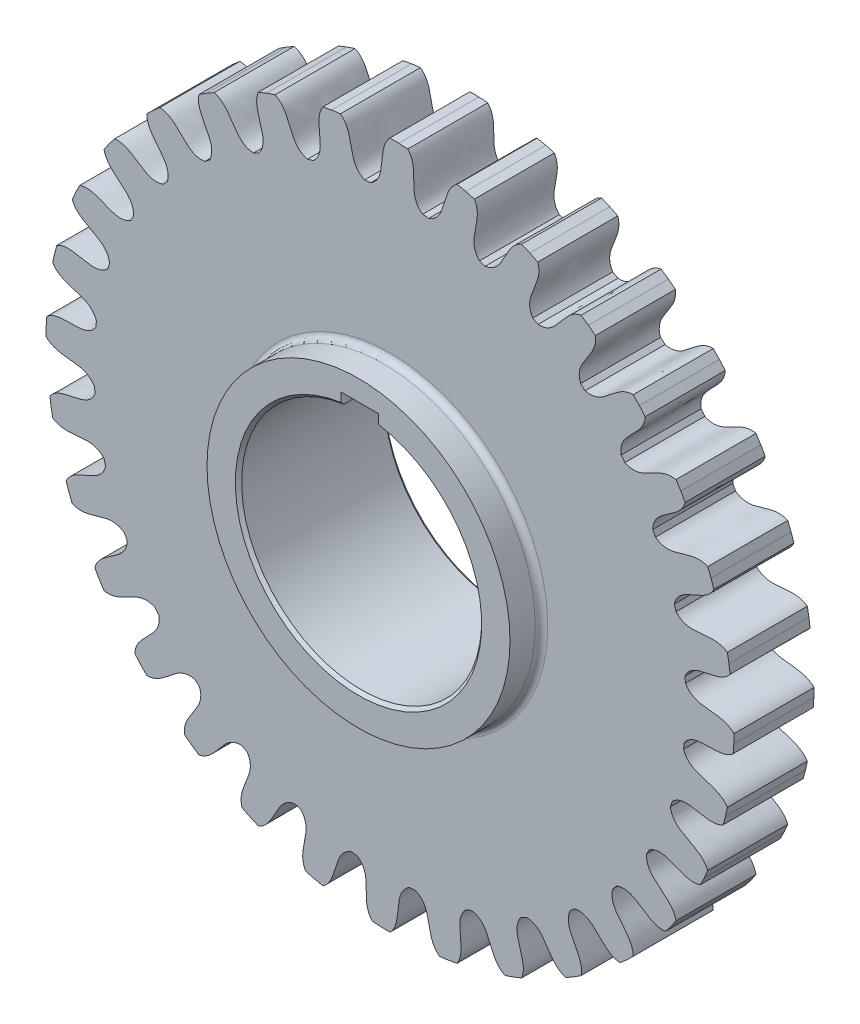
from build123d import *

# Parameters (mm, degrees)
AUFSATZ_LINEAR_AUSTRAGEN1_DEPTH = 13.081
SKIZZE2_R                       = 24.7715
AUFSATZ_LINEAR_AUSTRAGEN2_DEPTH = 5.15
AUFSATZ_LINEAR_START            = 6.18
SKIZZE3_R                       = 24.7715
AUFSATZ_LINEAR_AUSTRAGEN3_DEPTH = 6.18
SCHNITT_LINEAR_AUSTRAGEN1_DEPTH = 84.194484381
SKIZZE5_W                       = 19.6215
SKIZZE5_H                       = 24.411
FASE1_SIZE                      = 0.515
ZAHNRAD_R                       = 1.03


with BuildPart() as part:
    # Skizze1 → Aufsatz-Linear austragen1 (new body)
    with BuildSketch(Plane.XY.offset(13.081)):
        with BuildLine():
            Line((22.855064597, 51.384420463), (21.521350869, 51.957137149))
            add(Edge.make_bspline(
                [(15.55468588, 45.842991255), (18.896430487, 46.321686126), (18.613373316, 50.778897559), (21.521350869, 51.957137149)],
                knots=[0, 0, 0, 0, 1, 1, 1, 1], degree=3))
            ThreePointArc((15.55468588, 45.842991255), (15.090249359, 45.997961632), (14.624269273, 46.148226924))
            add(Edge.make_bspline(
                [(13.791563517, 54.473680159), (15.409186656, 51.825446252), (12.308759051, 48.516392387), (14.624269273, 46.148226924)],
                knots=[0, 0, 0, 0, 1, 1, 1, 1], degree=3))
            Line((13.791563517, 54.473680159), (12.391307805, 54.855885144))
            Line((12.391307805, 54.855885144), (10.97148953, 55.157402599))
            add(Edge.make_bspline(
                [(6.312283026, 47.996699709), (9.496428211, 49.118138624), (8.349251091, 53.434484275), (10.97148953, 55.157402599)],
                knots=[0, 0, 0, 0, 1, 1, 1, 1], degree=3))
            ThreePointArc((6.312283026, 47.996699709), (5.826537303, 48.058085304), (5.340195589, 48.114555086))
            add(Edge.make_bspline(
                [(2.899274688, 56.117584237), (5.002460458, 53.835818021), (2.607171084, 49.985483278), (5.340195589, 48.114555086)],
                knots=[0, 0, 0, 0, 1, 1, 1, 1], degree=3))
            Line((2.899274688, 56.117584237), (1.451360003, 56.219268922))
            Line((1.451360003, 56.219268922), (0, 56.238))
            add(Edge.make_bspline(
                [(-3.172697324, 48.305921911), (-0.268516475, 50.027008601), (-2.235728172, 54.036613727), (0, 56.238)],
                knots=[0, 0, 0, 0, 1, 1, 1, 1], degree=3))
            ThreePointArc((-3.172697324, 48.305921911), (-3.661085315, 48.271363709), (-4.149098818, 48.231867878))
            add(Edge.make_bspline(
                [(-8.104431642, 55.604921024), (-5.596507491, 53.777309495), (-7.194609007, 49.533660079), (-4.149098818, 48.231867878)],
                knots=[0, 0, 0, 0, 1, 1, 1, 1], degree=3))
            Line((-8.104431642, 55.604921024), (-9.54436275, 55.422177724))
            Line((-9.54436275, 55.422177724), (-10.97148953, 55.157402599))
            add(Edge.make_bspline(
                [(-12.535752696, 46.758774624), (-10.023142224, 49.013368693), (-12.734789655, 52.562146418), (-10.97148953, 55.157402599)],
                knots=[0, 0, 0, 0, 1, 1, 1, 1], degree=3))
            ThreePointArc((-12.535752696, 46.758774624), (-13.008014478, 46.629600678), (-13.478945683, 46.495657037))
            add(Edge.make_bspline(
                [(-18.796689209, 52.955391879), (-15.980404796, 51.652169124), (-16.719904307, 47.178286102), (-13.478945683, 46.495657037)],
                knots=[0, 0, 0, 0, 1, 1, 1, 1], degree=3))
            Line((-18.796689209, 52.955391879), (-20.173300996, 52.495243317))
            Line((-20.173300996, 52.495243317), (-21.521350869, 51.957137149))
            add(Edge.make_bspline(
                [(-21.417066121, 43.414713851), (-19.392584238, 46.116172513), (-22.744460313, 49.067745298), (-21.521350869, 51.957137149)],
                knots=[0, 0, 0, 0, 1, 1, 1, 1], degree=3))
            ThreePointArc((-21.417066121, 43.414713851), (-21.855052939, 43.195888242), (-22.290804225, 42.972644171))
            add(Edge.make_bspline(
                [(-28.766600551, 48.270816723), (-25.750184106, 47.54206486), (-25.602663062, 43.009877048), (-22.290804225, 42.972644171)],
                knots=[0, 0, 0, 0, 1, 1, 1, 1], degree=3))
            Line((-28.766600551, 48.270816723), (-30.026990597, 47.550946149))
            Line((-30.026990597, 47.550946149), (-31.244158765, 46.760188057))
            add(Edge.make_bspline(
                [(-29.475333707, 38.402249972), (-28.016780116, 41.446757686), (-31.880074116, 43.687698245), (-31.244158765, 46.760188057)],
                knots=[0, 0, 0, 0, 1, 1, 1, 1], degree=3))
            ThreePointArc((-29.475333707, 38.402249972), (-29.862213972, 38.102182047), (-30.246039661, 37.798216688))
            add(Edge.make_bspline(
                [(-37.631027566, 41.73122115), (-34.530398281, 41.604945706), (-33.501525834, 37.18862254), (-30.246039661, 37.798216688)],
                knots=[0, 0, 0, 0, 1, 1, 1, 1], degree=3))
            Line((-37.631027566, 41.73122115), (-38.726759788, 40.779292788))
            Line((-38.726759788, 40.779292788), (-39.76627116, 39.76627116))
            add(Edge.make_bspline(
                [(-36.400880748, 31.914009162), (-35.564306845, 35.184567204), (-39.79055455, 36.628757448), (-39.76627116, 39.76627116)],
                knots=[0, 0, 0, 0, 1, 1, 1, 1], degree=3))
            ThreePointArc((-36.400880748, 31.914009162), (-36.721786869, 31.544230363), (-37.038936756, 31.171224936))
            add(Edge.make_bspline(
                [(-45.049315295, 33.587918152), (-41.983628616, 34.06897182), (-40.112943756, 29.938230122), (-37.038936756, 31.171224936)],
                knots=[0, 0, 0, 0, 1, 1, 1, 1], degree=3))
            Line((-45.049315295, 33.587918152), (-45.93828132, 32.440514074))
            Line((-45.93828132, 32.440514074), (-46.760188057, 31.244158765))
            add(Edge.make_bspline(
                [(-41.927562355, 24.199330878), (-41.745117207, 27.570253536), (-46.171906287, 28.162194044), (-46.760188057, 31.244158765)],
                knots=[0, 0, 0, 0, 1, 1, 1, 1], degree=3))
            ThreePointArc((-41.927562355, 24.199330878), (-42.17016209, 23.774051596), (-42.408448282, 23.346340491))
            add(Edge.make_bspline(
                [(-50.736383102, 24.153850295), (-47.823451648, 25.223746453), (-45.182843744, 21.537328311), (-42.408448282, 23.346340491)],
                knots=[0, 0, 0, 0, 1, 1, 1, 1], degree=3))
            Line((-50.736383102, 24.153850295), (-51.384420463, 22.855064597))
            Line((-51.384420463, 22.855064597), (-51.957137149, 21.521350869))
            add(Edge.make_bspline(
                [(-45.842991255, 15.55468588), (-46.321686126, 18.896430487), (-50.778897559, 18.613373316), (-51.957137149, 21.521350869)],
                knots=[0, 0, 0, 0, 1, 1, 1, 1], degree=3))
            ThreePointArc((-45.842991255, 15.55468588), (-45.997961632, 15.090249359), (-46.148226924, 14.624269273))
            add(Edge.make_bspline(
                [(-54.473680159, 13.791563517), (-51.825446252, 15.409186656), (-48.516392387, 12.308759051), (-46.148226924, 14.624269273)],
                knots=[0, 0, 0, 0, 1, 1, 1, 1], degree=3))
            Line((-54.473680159, 13.791563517), (-54.855885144, 12.391307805))
            Line((-54.855885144, 12.391307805), (-55.157402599, 10.97148953))
            add(Edge.make_bspline(
                [(-47.996699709, 6.312283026), (-49.118138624, 9.496428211), (-53.434484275, 8.349251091), (-55.157402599, 10.97148953)],
                knots=[0, 0, 0, 0, 1, 1, 1, 1], degree=3))
            ThreePointArc((-47.996699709, 6.312283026), (-48.058085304, 5.826537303), (-48.114555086, 5.340195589))
            add(Edge.make_bspline(
                [(-56.117584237, 2.899274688), (-53.835818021, 5.002460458), (-49.985483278, 2.607171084), (-48.114555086, 5.340195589)],
                knots=[0, 0, 0, 0, 1, 1, 1, 1], degree=3))
            Line((-56.117584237, 2.899274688), (-56.219268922, 1.451360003))
            Line((-56.219268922, 1.451360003), (-56.238, 0))
            add(Edge.make_bspline(
                [(-48.305921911, -3.172697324), (-50.027008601, -0.268516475), (-54.036613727, -2.235728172), (-56.238, 0)],
                knots=[0, 0, 0, 0, 1, 1, 1, 1], degree=3))
            ThreePointArc((-48.305921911, -3.172697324), (-48.271363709, -3.661085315), (-48.231867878, -4.149098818))
            add(Edge.make_bspline(
                [(-55.604921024, -8.104431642), (-53.777309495, -5.596507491), (-49.533660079, -7.194609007), (-48.231867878, -4.149098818)],
                knots=[0, 0, 0, 0, 1, 1, 1, 1], degree=3))
            Line((-55.604921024, -8.104431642), (-55.422177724, -9.54436275))
            Line((-55.422177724, -9.54436275), (-55.157402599, -10.97148953))
            add(Edge.make_bspline(
                [(-46.758774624, -12.535752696), (-49.013368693, -10.023142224), (-52.562146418, -12.734789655), (-55.157402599, -10.97148953)],
                knots=[0, 0, 0, 0, 1, 1, 1, 1], degree=3))
            ThreePointArc((-46.758774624, -12.535752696), (-46.629600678, -13.008014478), (-46.495657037, -13.478945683))
            add(Edge.make_bspline(
                [(-52.955391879, -18.796689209), (-51.652169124, -15.980404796), (-47.178286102, -16.719904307), (-46.495657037, -13.478945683)],
                knots=[0, 0, 0, 0, 1, 1, 1, 1], degree=3))
            Line((-52.955391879, -18.796689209), (-52.495243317, -20.173300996))
            Line((-52.495243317, -20.173300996), (-51.957137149, -21.521350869))
            add(Edge.make_bspline(
                [(-43.414713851, -21.417066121), (-46.116172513, -19.392584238), (-49.067745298, -22.744460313), (-51.957137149, -21.521350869)],
                knots=[0, 0, 0, 0, 1, 1, 1, 1], degree=3))
            ThreePointArc((-43.414713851, -21.417066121), (-43.195888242, -21.855052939), (-42.972644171, -22.290804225))
            add(Edge.make_bspline(
                [(-48.270816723, -28.766600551), (-47.54206486, -25.750184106), (-43.009877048, -25.602663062), (-42.972644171, -22.290804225)],
                knots=[0, 0, 0, 0, 1, 1, 1, 1], degree=3))
            Line((-48.270816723, -28.766600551), (-47.550946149, -30.026990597))
            Line((-47.550946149, -30.026990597), (-46.760188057, -31.244158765))
            add(Edge.make_bspline(
                [(-38.402249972, -29.475333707), (-41.446757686, -28.016780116), (-43.687698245, -31.880074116), (-46.760188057, -31.244158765)],
                knots=[0, 0, 0, 0, 1, 1, 1, 1], degree=3))
            ThreePointArc((-38.402249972, -29.475333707), (-38.102182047, -29.862213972), (-37.798216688, -30.246039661))
            add(Edge.make_bspline(
                [(-41.73122115, -37.631027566), (-41.604945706, -34.530398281), (-37.18862254, -33.501525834), (-37.798216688, -30.246039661)],
                knots=[0, 0, 0, 0, 1, 1, 1, 1], degree=3))
            Line((-41.73122115, -37.631027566), (-40.779292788, -38.726759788))
            Line((-40.779292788, -38.726759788), (-39.76627116, -39.76627116))
            add(Edge.make_bspline(
                [(-31.914009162, -36.400880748), (-35.184567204, -35.564306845), (-36.628757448, -39.79055455), (-39.76627116, -39.76627116)],
                knots=[0, 0, 0, 0, 1, 1, 1, 1], degree=3))
            ThreePointArc((-31.914009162, -36.400880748), (-31.544230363, -36.721786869), (-31.171224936, -37.038936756))
            add(Edge.make_bspline(
                [(-33.587918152, -45.049315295), (-34.06897182, -41.983628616), (-29.938230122, -40.112943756), (-31.171224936, -37.038936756)],
                knots=[0, 0, 0, 0, 1, 1, 1, 1], degree=3))
            Line((-33.587918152, -45.049315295), (-32.440514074, -45.93828132))
            Line((-32.440514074, -45.93828132), (-31.244158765, -46.760188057))
            add(Edge.make_bspline(
                [(-24.199330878, -41.927562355), (-27.570253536, -41.745117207), (-28.162194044, -46.171906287), (-31.244158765, -46.760188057)],
                knots=[0, 0, 0, 0, 1, 1, 1, 1], degree=3))
            ThreePointArc((-24.199330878, -41.927562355), (-23.774051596, -42.17016209), (-23.346340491, -42.408448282))
            add(Edge.make_bspline(
                [(-24.153850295, -50.736383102), (-25.223746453, -47.823451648), (-21.537328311, -45.182843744), (-23.346340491, -42.408448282)],
                knots=[0, 0, 0, 0, 1, 1, 1, 1], degree=3))
            Line((-24.153850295, -50.736383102), (-22.855064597, -51.384420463))
            Line((-22.855064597, -51.384420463), (-21.521350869, -51.957137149))
            add(Edge.make_bspline(
                [(-15.55468588, -45.842991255), (-18.896430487, -46.321686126), (-18.613373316, -50.778897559), (-21.521350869, -51.957137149)],
                knots=[0, 0, 0, 0, 1, 1, 1, 1], degree=3))
            ThreePointArc((-15.55468588, -45.842991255), (-15.090249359, -45.997961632), (-14.624269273, -46.148226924))
            add(Edge.make_bspline(
                [(-13.791563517, -54.473680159), (-15.409186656, -51.825446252), (-12.308759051, -48.516392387), (-14.624269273, -46.148226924)],
                knots=[0, 0, 0, 0, 1, 1, 1, 1], degree=3))
            Line((-13.791563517, -54.473680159), (-12.391307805, -54.855885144))
            Line((-12.391307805, -54.855885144), (-10.97148953, -55.157402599))
            add(Edge.make_bspline(
                [(-6.312283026, -47.996699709), (-9.496428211, -49.118138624), (-8.349251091, -53.434484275), (-10.97148953, -55.157402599)],
                knots=[0, 0, 0, 0, 1, 1, 1, 1], degree=3))
            ThreePointArc((-6.312283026, -47.996699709), (-5.826537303, -48.058085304), (-5.340195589, -48.114555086))
            add(Edge.make_bspline(
                [(-2.899274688, -56.117584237), (-5.002460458, -53.835818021), (-2.607171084, -49.985483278), (-5.340195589, -48.114555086)],
                knots=[0, 0, 0, 0, 1, 1, 1, 1], degree=3))
            Line((-2.899274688, -56.117584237), (-1.451360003, -56.219268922))
            Line((-1.451360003, -56.219268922), (0, -56.238))
            add(Edge.make_bspline(
                [(3.172697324, -48.305921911), (0.268516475, -50.027008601), (2.235728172, -54.036613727), (0, -56.238)],
                knots=[0, 0, 0, 0, 1, 1, 1, 1], degree=3))
            ThreePointArc((3.172697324, -48.305921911), (3.661085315, -48.271363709), (4.149098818, -48.231867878))
            add(Edge.make_bspline(
                [(8.104431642, -55.604921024), (5.596507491, -53.777309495), (7.194609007, -49.533660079), (4.149098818, -48.231867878)],
                knots=[0, 0, 0, 0, 1, 1, 1, 1], degree=3))
            Line((8.104431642, -55.604921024), (9.54436275, -55.422177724))
            Line((9.54436275, -55.422177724), (10.97148953, -55.157402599))
            add(Edge.make_bspline(
                [(12.535752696, -46.758774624), (10.023142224, -49.013368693), (12.734789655, -52.562146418), (10.97148953, -55.157402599)],
                knots=[0, 0, 0, 0, 1, 1, 1, 1], degree=3))
            ThreePointArc((12.535752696, -46.758774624), (13.008014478, -46.629600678), (13.478945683, -46.495657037))
            add(Edge.make_bspline(
                [(18.796689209, -52.955391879), (15.980404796, -51.652169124), (16.719904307, -47.178286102), (13.478945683, -46.495657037)],
                knots=[0, 0, 0, 0, 1, 1, 1, 1], degree=3))
            Line((18.796689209, -52.955391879), (20.173300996, -52.495243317))
            Line((20.173300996, -52.495243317), (21.521350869, -51.957137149))
            add(Edge.make_bspline(
                [(21.417066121, -43.414713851), (19.392584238, -46.116172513), (22.744460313, -49.067745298), (21.521350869, -51.957137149)],
                knots=[0, 0, 0, 0, 1, 1, 1, 1], degree=3))
            ThreePointArc((21.417066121, -43.414713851), (21.855052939, -43.195888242), (22.290804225, -42.972644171))
            add(Edge.make_bspline(
                [(28.766600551, -48.270816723), (25.750184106, -47.54206486), (25.602663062, -43.009877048), (22.290804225, -42.972644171)],
                knots=[0, 0, 0, 0, 1, 1, 1, 1], degree=3))
            Line((28.766600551, -48.270816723), (30.026990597, -47.550946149))
            Line((30.026990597, -47.550946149), (31.244158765, -46.760188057))
            add(Edge.make_bspline(
                [(29.475333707, -38.402249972), (28.016780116, -41.446757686), (31.880074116, -43.687698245), (31.244158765, -46.760188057)],
                knots=[0, 0, 0, 0, 1, 1, 1, 1], degree=3))
            ThreePointArc((29.475333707, -38.402249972), (29.862213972, -38.102182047), (30.246039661, -37.798216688))
            add(Edge.make_bspline(
                [(37.631027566, -41.73122115), (34.530398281, -41.604945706), (33.501525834, -37.18862254), (30.246039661, -37.798216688)],
                knots=[0, 0, 0, 0, 1, 1, 1, 1], degree=3))
            Line((37.631027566, -41.73122115), (38.726759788, -40.779292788))
            Line((38.726759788, -40.779292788), (39.76627116, -39.76627116))
            add(Edge.make_bspline(
                [(36.400880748, -31.914009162), (35.564306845, -35.184567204), (39.79055455, -36.628757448), (39.76627116, -39.76627116)],
                knots=[0, 0, 0, 0, 1, 1, 1, 1], degree=3))
            ThreePointArc((36.400880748, -31.914009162), (36.721786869, -31.544230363), (37.038936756, -31.171224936))
            add(Edge.make_bspline(
                [(45.049315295, -33.587918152), (41.983628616, -34.06897182), (40.112943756, -29.938230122), (37.038936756, -31.171224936)],
                knots=[0, 0, 0, 0, 1, 1, 1, 1], degree=3))
            Line((45.049315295, -33.587918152), (45.93828132, -32.440514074))
            Line((45.93828132, -32.440514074), (46.760188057, -31.244158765))
            add(Edge.make_bspline(
                [(41.927562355, -24.199330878), (41.745117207, -27.570253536), (46.171906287, -28.162194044), (46.760188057, -31.244158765)],
                knots=[0, 0, 0, 0, 1, 1, 1, 1], degree=3))
            ThreePointArc((41.927562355, -24.199330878), (42.17016209, -23.774051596), (42.408448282, -23.346340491))
            add(Edge.make_bspline(
                [(50.736383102, -24.153850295), (47.823451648, -25.223746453), (45.182843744, -21.537328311), (42.408448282, -23.346340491)],
                knots=[0, 0, 0, 0, 1, 1, 1, 1], degree=3))
            Line((50.736383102, -24.153850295), (51.384420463, -22.855064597))
            Line((51.384420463, -22.855064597), (51.957137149, -21.521350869))
            add(Edge.make_bspline(
                [(45.842991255, -15.55468588), (46.321686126, -18.896430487), (50.778897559, -18.613373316), (51.957137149, -21.521350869)],
                knots=[0, 0, 0, 0, 1, 1, 1, 1], degree=3))
            ThreePointArc((45.842991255, -15.55468588), (45.997961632, -15.090249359), (46.148226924, -14.624269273))
            add(Edge.make_bspline(
                [(54.473680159, -13.791563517), (51.825446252, -15.409186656), (48.516392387, -12.308759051), (46.148226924, -14.624269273)],
                knots=[0, 0, 0, 0, 1, 1, 1, 1], degree=3))
            Line((54.473680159, -13.791563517), (54.855885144, -12.391307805))
            Line((54.855885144, -12.391307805), (55.157402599, -10.97148953))
            add(Edge.make_bspline(
                [(47.996699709, -6.312283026), (49.118138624, -9.496428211), (53.434484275, -8.349251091), (55.157402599, -10.97148953)],
                knots=[0, 0, 0, 0, 1, 1, 1, 1], degree=3))
            ThreePointArc((47.996699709, -6.312283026), (48.058085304, -5.826537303), (48.114555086, -5.340195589))
            add(Edge.make_bspline(
                [(56.117584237, -2.899274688), (53.835818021, -5.002460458), (49.985483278, -2.607171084), (48.114555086, -5.340195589)],
                knots=[0, 0, 0, 0, 1, 1, 1, 1], degree=3))
            Line((56.117584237, -2.899274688), (56.219268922, -1.451360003))
            Line((56.219268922, -1.451360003), (56.238, 0))
            add(Edge.make_bspline(
                [(48.305921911, 3.172697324), (50.027008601, 0.268516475), (54.036613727, 2.235728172), (56.238, 0)],
                knots=[0, 0, 0, 0, 1, 1, 1, 1], degree=3))
            ThreePointArc((48.305921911, 3.172697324), (48.271363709, 3.661085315), (48.231867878, 4.149098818))
            add(Edge.make_bspline(
                [(55.604921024, 8.104431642), (53.777309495, 5.596507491), (49.533660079, 7.194609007), (48.231867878, 4.149098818)],
                knots=[0, 0, 0, 0, 1, 1, 1, 1], degree=3))
            Line((55.604921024, 8.104431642), (55.422177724, 9.54436275))
            Line((55.422177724, 9.54436275), (55.157402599, 10.97148953))
            add(Edge.make_bspline(
                [(46.758774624, 12.535752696), (49.013368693, 10.023142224), (52.562146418, 12.734789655), (55.157402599, 10.97148953)],
                knots=[0, 0, 0, 0, 1, 1, 1, 1], degree=3))
            ThreePointArc((46.758774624, 12.535752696), (46.629600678, 13.008014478), (46.495657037, 13.478945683))
            add(Edge.make_bspline(
                [(52.955391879, 18.796689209), (51.652169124, 15.980404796), (47.178286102, 16.719904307), (46.495657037, 13.478945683)],
                knots=[0, 0, 0, 0, 1, 1, 1, 1], degree=3))
            Line((52.955391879, 18.796689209), (52.495243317, 20.173300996))
            Line((52.495243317, 20.173300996), (51.957137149, 21.521350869))
            add(Edge.make_bspline(
                [(43.414713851, 21.417066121), (46.116172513, 19.392584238), (49.067745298, 22.744460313), (51.957137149, 21.521350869)],
                knots=[0, 0, 0, 0, 1, 1, 1, 1], degree=3))
            ThreePointArc((43.414713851, 21.417066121), (43.195888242, 21.855052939), (42.972644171, 22.290804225))
            add(Edge.make_bspline(
                [(48.270816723, 28.766600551), (47.54206486, 25.750184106), (43.009877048, 25.602663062), (42.972644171, 22.290804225)],
                knots=[0, 0, 0, 0, 1, 1, 1, 1], degree=3))
            Line((48.270816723, 28.766600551), (47.550946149, 30.026990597))
            Line((47.550946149, 30.026990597), (46.760188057, 31.244158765))
            add(Edge.make_bspline(
                [(38.402249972, 29.475333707), (41.446757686, 28.016780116), (43.687698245, 31.880074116), (46.760188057, 31.244158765)],
                knots=[0, 0, 0, 0, 1, 1, 1, 1], degree=3))
            ThreePointArc((38.402249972, 29.475333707), (38.102182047, 29.862213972), (37.798216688, 30.246039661))
            add(Edge.make_bspline(
                [(41.73122115, 37.631027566), (41.604945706, 34.530398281), (37.18862254, 33.501525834), (37.798216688, 30.246039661)],
                knots=[0, 0, 0, 0, 1, 1, 1, 1], degree=3))
            Line((41.73122115, 37.631027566), (40.779292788, 38.726759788))
            Line((40.779292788, 38.726759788), (39.76627116, 39.76627116))
            add(Edge.make_bspline(
                [(31.914009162, 36.400880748), (35.184567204, 35.564306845), (36.628757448, 39.79055455), (39.76627116, 39.76627116)],
                knots=[0, 0, 0, 0, 1, 1, 1, 1], degree=3))
            ThreePointArc((31.914009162, 36.400880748), (31.544230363, 36.721786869), (31.171224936, 37.038936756))
            add(Edge.make_bspline(
                [(33.587918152, 45.049315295), (34.06897182, 41.983628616), (29.938230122, 40.112943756), (31.171224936, 37.038936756)],
                knots=[0, 0, 0, 0, 1, 1, 1, 1], degree=3))
            Line((33.587918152, 45.049315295), (32.440514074, 45.93828132))
            Line((32.440514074, 45.93828132), (31.244158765, 46.760188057))
            add(Edge.make_bspline(
                [(24.199330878, 41.927562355), (27.570253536, 41.745117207), (28.162194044, 46.171906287), (31.244158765, 46.760188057)],
                knots=[0, 0, 0, 0, 1, 1, 1, 1], degree=3))
            ThreePointArc((24.199330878, 41.927562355), (23.774051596, 42.17016209), (23.346340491, 42.408448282))
            add(Edge.make_bspline(
                [(24.153850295, 50.736383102), (25.223746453, 47.823451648), (21.537328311, 45.182843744), (23.346340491, 42.408448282)],
                knots=[0, 0, 0, 0, 1, 1, 1, 1], degree=3))
            Line((24.153850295, 50.736383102), (22.855064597, 51.384420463))
        make_face()
    extrude(amount=-AUFSATZ_LINEAR_AUSTRAGEN1_DEPTH)

    # Skizze2 → Aufsatz-Linear austragen2 (add)
    with BuildSketch(Plane.XY.offset(13.081)):
        with Locations(Location((0, 0, 0), (0, 0, 180))):
            Circle(SKIZZE2_R)
    extrude(amount=AUFSATZ_LINEAR_AUSTRAGEN2_DEPTH)

    # Skizze3 → Aufsatz-Linear austragen3 (add)
    with BuildSketch(Plane(origin=(0, 0, 0), x_dir=(-1, 0, 0), z_dir=(0, 0, -1)).offset(AUFSATZ_LINEAR_START)):
        Circle(SKIZZE3_R)
    extrude(amount=-AUFSATZ_LINEAR_AUSTRAGEN3_DEPTH)

    # Skizze4 → Schnitt-Linear austragen1 (cut, through all)
    with BuildSketch(Plane(origin=(0, 0, -6.18), x_dir=(-1, 0, 0), z_dir=(0, 0, -1))):
        with BuildLine():
            Line((2.897984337, 21.405067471), (-3.282015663, 21.405067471))
            Line((-3.282015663, 21.405067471), (-3.282015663, 19.345067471))
            ThreePointArc((-3.282015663, 19.345067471), (-0.194442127, 19.62053655), (2.897984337, 19.406312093))
            Line((2.897984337, 19.406312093), (2.897984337, 21.405067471))
        make_face()
    extrude(amount=-SCHNITT_LINEAR_AUSTRAGEN1_DEPTH, mode=Mode.SUBTRACT)

    # Skizze5 → Schnitt-Rotation1 (revolve, cut)
    with BuildSketch(Plane(origin=(0, 0, 0), x_dir=(1, 0, 0), z_dir=(0, 1, 0))):
        with Locations((9.81075, -6.0255)):
            Rectangle(SKIZZE5_W, SKIZZE5_H)
    revolve(axis=Axis((0, 0, -6.18), (0, 0, 1)), mode=Mode.SUBTRACT)

    # Fase1
    fase1_edges = [part.edges().sort_by_distance(p)[0] for p in [
        (-0.194442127, -19.62053655, -6.18),
        (-0.194442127, -19.62053655, 18.231),
    ]]
    chamfer(fase1_edges, length=FASE1_SIZE)

    # Zahnrad
    zahnrad_edges = [part.edges().sort_by_distance(p)[0] for p in [
        (24.7715, 0, 13.081),
        (24.7715, 0, 0),
    ]]
    fillet(zahnrad_edges, radius=ZAHNRAD_R)


solid = part.part
